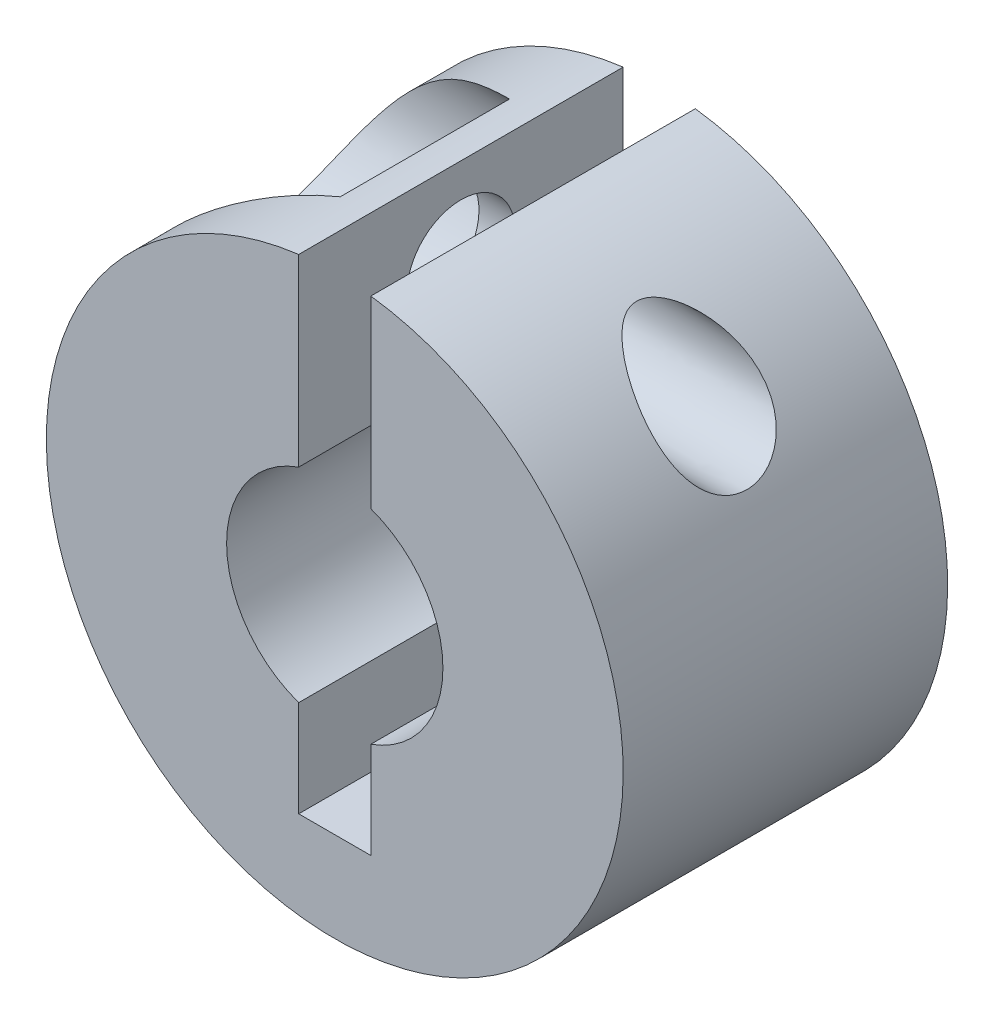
ISO-10303-21;
HEADER;
FILE_DESCRIPTION(('STEP AP214'),'2;1');
FILE_NAME('part.step','',(''),(''),'','','');
FILE_SCHEMA(('AUTOMOTIVE_DESIGN { 1 0 10303 214 1 1 1 1 }'));
ENDSEC;
DATA;
#1=APPLICATION_CONTEXT('core data for automotive mechanical design processes');
#2=APPLICATION_PROTOCOL_DEFINITION('international standard','automotive_design',2000,#1);
#3=PRODUCT_CONTEXT('',#1,'mechanical');
#4=PRODUCT('Part','Part','',(#3));
#5=PRODUCT_RELATED_PRODUCT_CATEGORY('part','',(#4));
#6=PRODUCT_DEFINITION_FORMATION('','',#4);
#7=PRODUCT_DEFINITION_CONTEXT('part definition',#1,'design');
#8=PRODUCT_DEFINITION('design','',#6,#7);
#9=PRODUCT_DEFINITION_SHAPE('','',#8);
#10=(LENGTH_UNIT() NAMED_UNIT(*) SI_UNIT(.MILLI.,.METRE.));
#11=(NAMED_UNIT(*) PLANE_ANGLE_UNIT() SI_UNIT($,.RADIAN.));
#12=(NAMED_UNIT(*) SI_UNIT($,.STERADIAN.) SOLID_ANGLE_UNIT());
#13=UNCERTAINTY_MEASURE_WITH_UNIT(LENGTH_MEASURE(1.E-05),#10,'distance_accuracy_value','');
#14=(GEOMETRIC_REPRESENTATION_CONTEXT(3) GLOBAL_UNCERTAINTY_ASSIGNED_CONTEXT((#13)) GLOBAL_UNIT_ASSIGNED_CONTEXT((#10,
#11,#12)) REPRESENTATION_CONTEXT('',''));
#15=CARTESIAN_POINT('',(0.,0.,0.));
#16=DIRECTION('',(0.,0.,1.));
#17=DIRECTION('',(1.,0.,0.));
#18=AXIS2_PLACEMENT_3D('',#15,#16,#17);
#19=CARTESIAN_POINT('',(0.,0.,4.5));
#20=DIRECTION('',(0.,0.,1.));
#21=DIRECTION('',(1.,0.,0.));
#22=AXIS2_PLACEMENT_3D('',#19,#20,#21);
#23=PLANE('',#22);
#24=DIRECTION('',(0.,-1.,0.));
#25=VECTOR('',#24,1.);
#26=CARTESIAN_POINT('',(1.,-2.75,4.5));
#27=LINE('',#26,#25);
#28=CARTESIAN_POINT('',(1.,7.93725393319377,4.5));
#29=VERTEX_POINT('',#28);
#30=CARTESIAN_POINT('',(1.,2.82842712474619,4.5));
#31=VERTEX_POINT('',#30);
#32=EDGE_CURVE('E10',#29,#31,#27,.T.);
#33=ORIENTED_EDGE('',*,*,#32,.T.);
#34=CARTESIAN_POINT('',(0.,0.,4.5));
#35=DIRECTION('',(0.,0.,1.));
#36=DIRECTION('',(1.,0.,0.));
#37=AXIS2_PLACEMENT_3D('',#34,#35,#36);
#38=CIRCLE('',#37,3.);
#39=CARTESIAN_POINT('',(1.,-2.82842712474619,4.5));
#40=VERTEX_POINT('',#39);
#41=EDGE_CURVE('E187',#40,#31,#38,.T.);
#42=ORIENTED_EDGE('',*,*,#41,.F.);
#43=DIRECTION('',(0.,-1.,0.));
#44=VECTOR('',#43,1.);
#45=CARTESIAN_POINT('',(1.,-2.75,4.5));
#46=LINE('',#45,#44);
#47=CARTESIAN_POINT('',(1.,-5.5,4.5));
#48=VERTEX_POINT('',#47);
#49=EDGE_CURVE('E30',#40,#48,#46,.T.);
#50=ORIENTED_EDGE('',*,*,#49,.T.);
#51=DIRECTION('',(-1.,0.,0.));
#52=VECTOR('',#51,1.);
#53=CARTESIAN_POINT('',(-0.5,-5.5,4.5));
#54=LINE('',#53,#52);
#55=CARTESIAN_POINT('',(-1.,-5.5,4.5));
#56=VERTEX_POINT('',#55);
#57=EDGE_CURVE('E135',#48,#56,#54,.T.);
#58=ORIENTED_EDGE('',*,*,#57,.T.);
#59=DIRECTION('',(0.,1.,0.));
#60=VECTOR('',#59,1.);
#61=CARTESIAN_POINT('',(-1.,4.,4.5));
#62=LINE('',#61,#60);
#63=CARTESIAN_POINT('',(-1.,-2.82842712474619,4.5));
#64=VERTEX_POINT('',#63);
#65=EDGE_CURVE('E113',#56,#64,#62,.T.);
#66=ORIENTED_EDGE('',*,*,#65,.T.);
#67=CARTESIAN_POINT('',(0.,0.,4.5));
#68=DIRECTION('',(0.,0.,1.));
#69=DIRECTION('',(1.,0.,0.));
#70=AXIS2_PLACEMENT_3D('',#67,#68,#69);
#71=CIRCLE('',#70,3.);
#72=CARTESIAN_POINT('',(-1.,2.82842712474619,4.5));
#73=VERTEX_POINT('',#72);
#74=EDGE_CURVE('E107',#73,#64,#71,.T.);
#75=ORIENTED_EDGE('',*,*,#74,.F.);
#76=DIRECTION('',(0.,1.,0.));
#77=VECTOR('',#76,1.);
#78=CARTESIAN_POINT('',(-1.,4.,4.5));
#79=LINE('',#78,#77);
#80=CARTESIAN_POINT('',(-1.,7.93725393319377,4.5));
#81=VERTEX_POINT('',#80);
#82=EDGE_CURVE('E110',#73,#81,#79,.T.);
#83=ORIENTED_EDGE('',*,*,#82,.T.);
#84=CARTESIAN_POINT('',(0.,0.,4.5));
#85=DIRECTION('',(0.,0.,1.));
#86=DIRECTION('',(1.,0.,0.));
#87=AXIS2_PLACEMENT_3D('',#84,#85,#86);
#88=CIRCLE('',#87,8.);
#89=EDGE_CURVE('E123',#81,#29,#88,.T.);
#90=ORIENTED_EDGE('',*,*,#89,.T.);
#91=EDGE_LOOP('',(#33,#42,#50,#58,#66,#75,#83,#90));
#92=FACE_BOUND('',#91,.T.);
#93=ADVANCED_FACE('F15',(#92),#23,.T.);
#94=CARTESIAN_POINT('',(0.,0.,-4.5));
#95=DIRECTION('',(0.,0.,-1.));
#96=DIRECTION('',(-1.,0.,0.));
#97=AXIS2_PLACEMENT_3D('',#94,#95,#96);
#98=PLANE('',#97);
#99=DIRECTION('',(0.,1.,0.));
#100=VECTOR('',#99,1.);
#101=CARTESIAN_POINT('',(1.,-2.75,-4.5));
#102=LINE('',#101,#100);
#103=CARTESIAN_POINT('',(1.,2.82842712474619,-4.5));
#104=VERTEX_POINT('',#103);
#105=CARTESIAN_POINT('',(1.,7.93725393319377,-4.5));
#106=VERTEX_POINT('',#105);
#107=EDGE_CURVE('E139',#104,#106,#102,.T.);
#108=ORIENTED_EDGE('',*,*,#107,.T.);
#109=CARTESIAN_POINT('',(0.,0.,-4.5));
#110=DIRECTION('',(0.,0.,1.));
#111=DIRECTION('',(1.,0.,0.));
#112=AXIS2_PLACEMENT_3D('',#109,#110,#111);
#113=CIRCLE('',#112,8.);
#114=CARTESIAN_POINT('',(-1.,7.93725393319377,-4.5));
#115=VERTEX_POINT('',#114);
#116=EDGE_CURVE('E133',#115,#106,#113,.T.);
#117=ORIENTED_EDGE('',*,*,#116,.F.);
#118=DIRECTION('',(0.,-1.,0.));
#119=VECTOR('',#118,1.);
#120=CARTESIAN_POINT('',(-1.,4.,-4.5));
#121=LINE('',#120,#119);
#122=CARTESIAN_POINT('',(-1.,2.82842712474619,-4.5));
#123=VERTEX_POINT('',#122);
#124=EDGE_CURVE('E141',#115,#123,#121,.T.);
#125=ORIENTED_EDGE('',*,*,#124,.T.);
#126=CARTESIAN_POINT('',(0.,0.,-4.5));
#127=DIRECTION('',(0.,0.,-1.));
#128=DIRECTION('',(1.,0.,0.));
#129=AXIS2_PLACEMENT_3D('',#126,#127,#128);
#130=CIRCLE('',#129,3.);
#131=CARTESIAN_POINT('',(-1.,-2.82842712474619,-4.5));
#132=VERTEX_POINT('',#131);
#133=EDGE_CURVE('E127',#132,#123,#130,.T.);
#134=ORIENTED_EDGE('',*,*,#133,.F.);
#135=DIRECTION('',(0.,-1.,0.));
#136=VECTOR('',#135,1.);
#137=CARTESIAN_POINT('',(-1.,4.,-4.5));
#138=LINE('',#137,#136);
#139=CARTESIAN_POINT('',(-1.,-5.5,-4.5));
#140=VERTEX_POINT('',#139);
#141=EDGE_CURVE('E202',#132,#140,#138,.T.);
#142=ORIENTED_EDGE('',*,*,#141,.T.);
#143=DIRECTION('',(1.,0.,0.));
#144=VECTOR('',#143,1.);
#145=CARTESIAN_POINT('',(-0.5,-5.5,-4.5));
#146=LINE('',#145,#144);
#147=CARTESIAN_POINT('',(1.,-5.5,-4.5));
#148=VERTEX_POINT('',#147);
#149=EDGE_CURVE('E199',#140,#148,#146,.T.);
#150=ORIENTED_EDGE('',*,*,#149,.T.);
#151=DIRECTION('',(0.,1.,0.));
#152=VECTOR('',#151,1.);
#153=CARTESIAN_POINT('',(1.,-2.75,-4.5));
#154=LINE('',#153,#152);
#155=CARTESIAN_POINT('',(1.,-2.82842712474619,-4.5));
#156=VERTEX_POINT('',#155);
#157=EDGE_CURVE('E191',#148,#156,#154,.T.);
#158=ORIENTED_EDGE('',*,*,#157,.T.);
#159=CARTESIAN_POINT('',(0.,0.,-4.5));
#160=DIRECTION('',(0.,0.,-1.));
#161=DIRECTION('',(1.,0.,0.));
#162=AXIS2_PLACEMENT_3D('',#159,#160,#161);
#163=CIRCLE('',#162,3.);
#164=EDGE_CURVE('E88',#104,#156,#163,.T.);
#165=ORIENTED_EDGE('',*,*,#164,.F.);
#166=EDGE_LOOP('',(#108,#117,#125,#134,#142,#150,#158,#165));
#167=FACE_BOUND('',#166,.T.);
#168=ADVANCED_FACE('F209',(#167),#98,.T.);
#169=CARTESIAN_POINT('',(-1.,8.,9.));
#170=DIRECTION('',(1.,0.,0.));
#171=DIRECTION('',(0.,0.,-1.));
#172=AXIS2_PLACEMENT_3D('',#169,#170,#171);
#173=PLANE('',#172);
#174=ORIENTED_EDGE('',*,*,#141,.F.);
#175=DIRECTION('',(0.,0.,-1.));
#176=VECTOR('',#175,1.);
#177=CARTESIAN_POINT('',(-1.,-2.82842712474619,0.));
#178=LINE('',#177,#176);
#179=EDGE_CURVE('E101',#64,#132,#178,.T.);
#180=ORIENTED_EDGE('',*,*,#179,.F.);
#181=ORIENTED_EDGE('',*,*,#65,.F.);
#182=DIRECTION('',(0.,0.,-1.));
#183=VECTOR('',#182,1.);
#184=CARTESIAN_POINT('',(-1.,-5.5,9.));
#185=LINE('',#184,#183);
#186=EDGE_CURVE('E189',#56,#140,#185,.T.);
#187=ORIENTED_EDGE('',*,*,#186,.T.);
#188=EDGE_LOOP('',(#174,#180,#181,#187));
#189=FACE_BOUND('',#188,.T.);
#190=ADVANCED_FACE('F211',(#189),#173,.T.);
#191=CARTESIAN_POINT('',(-1.,-5.5,9.));
#192=DIRECTION('',(0.,1.,0.));
#193=DIRECTION('',(0.,0.,1.));
#194=AXIS2_PLACEMENT_3D('',#191,#192,#193);
#195=PLANE('',#194);
#196=ORIENTED_EDGE('',*,*,#149,.F.);
#197=ORIENTED_EDGE('',*,*,#186,.F.);
#198=ORIENTED_EDGE('',*,*,#57,.F.);
#199=DIRECTION('',(0.,0.,-1.));
#200=VECTOR('',#199,1.);
#201=CARTESIAN_POINT('',(1.,-5.5,9.));
#202=LINE('',#201,#200);
#203=EDGE_CURVE('E182',#48,#148,#202,.T.);
#204=ORIENTED_EDGE('',*,*,#203,.T.);
#205=EDGE_LOOP('',(#196,#197,#198,#204));
#206=FACE_BOUND('',#205,.T.);
#207=ADVANCED_FACE('F218',(#206),#195,.T.);
#208=CARTESIAN_POINT('',(-1.,8.,9.));
#209=DIRECTION('',(1.,0.,0.));
#210=DIRECTION('',(0.,0.,-1.));
#211=AXIS2_PLACEMENT_3D('',#208,#209,#210);
#212=PLANE('',#211);
#213=CARTESIAN_POINT('',(-1.,5.50000000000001,0.));
#214=DIRECTION('',(-1.,0.,0.));
#215=DIRECTION('',(0.,1.,0.));
#216=AXIS2_PLACEMENT_3D('',#213,#214,#215);
#217=CIRCLE('',#216,1.49999999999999);
#218=CARTESIAN_POINT('',(-1.,7.,0.));
#219=VERTEX_POINT('',#218);
#220=EDGE_CURVE('E177',#219,#219,#217,.T.);
#221=ORIENTED_EDGE('',*,*,#220,.T.);
#222=EDGE_LOOP('',(#221));
#223=FACE_BOUND('',#222,.T.);
#224=DIRECTION('',(0.,0.,-1.));
#225=VECTOR('',#224,1.);
#226=CARTESIAN_POINT('',(-1.,7.93725393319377,0.));
#227=LINE('',#226,#225);
#228=EDGE_CURVE('E122',#81,#115,#227,.T.);
#229=ORIENTED_EDGE('',*,*,#228,.F.);
#230=ORIENTED_EDGE('',*,*,#82,.F.);
#231=DIRECTION('',(0.,0.,1.));
#232=VECTOR('',#231,1.);
#233=CARTESIAN_POINT('',(-1.,2.82842712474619,0.));
#234=LINE('',#233,#232);
#235=EDGE_CURVE('E116',#123,#73,#234,.T.);
#236=ORIENTED_EDGE('',*,*,#235,.F.);
#237=ORIENTED_EDGE('',*,*,#124,.F.);
#238=EDGE_LOOP('',(#229,#230,#236,#237));
#239=FACE_BOUND('',#238,.T.);
#240=ADVANCED_FACE('F120',(#223,#239),#212,.T.);
#241=CARTESIAN_POINT('',(1.,-5.5,9.));
#242=DIRECTION('',(-1.,0.,0.));
#243=DIRECTION('',(0.,0.,1.));
#244=AXIS2_PLACEMENT_3D('',#241,#242,#243);
#245=PLANE('',#244);
#246=ORIENTED_EDGE('',*,*,#157,.F.);
#247=ORIENTED_EDGE('',*,*,#203,.F.);
#248=ORIENTED_EDGE('',*,*,#49,.F.);
#249=DIRECTION('',(0.,0.,1.));
#250=VECTOR('',#249,1.);
#251=CARTESIAN_POINT('',(1.,-2.82842712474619,0.));
#252=LINE('',#251,#250);
#253=EDGE_CURVE('E137',#156,#40,#252,.T.);
#254=ORIENTED_EDGE('',*,*,#253,.F.);
#255=EDGE_LOOP('',(#246,#247,#248,#254));
#256=FACE_BOUND('',#255,.T.);
#257=ADVANCED_FACE('F227',(#256),#245,.T.);
#258=CARTESIAN_POINT('',(1.,-5.5,9.));
#259=DIRECTION('',(-1.,0.,0.));
#260=DIRECTION('',(0.,0.,1.));
#261=AXIS2_PLACEMENT_3D('',#258,#259,#260);
#262=PLANE('',#261);
#263=CARTESIAN_POINT('',(1.,5.50000000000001,0.));
#264=DIRECTION('',(1.,0.,0.));
#265=DIRECTION('',(0.,1.,0.));
#266=AXIS2_PLACEMENT_3D('',#263,#264,#265);
#267=CIRCLE('',#266,1.49999999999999);
#268=CARTESIAN_POINT('',(1.,7.,0.));
#269=VERTEX_POINT('',#268);
#270=EDGE_CURVE('E174',#269,#269,#267,.T.);
#271=ORIENTED_EDGE('',*,*,#270,.T.);
#272=EDGE_LOOP('',(#271));
#273=FACE_BOUND('',#272,.T.);
#274=DIRECTION('',(0.,0.,1.));
#275=VECTOR('',#274,1.);
#276=CARTESIAN_POINT('',(1.,7.93725393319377,0.));
#277=LINE('',#276,#275);
#278=EDGE_CURVE('E195',#106,#29,#277,.T.);
#279=ORIENTED_EDGE('',*,*,#278,.F.);
#280=ORIENTED_EDGE('',*,*,#107,.F.);
#281=DIRECTION('',(0.,0.,-1.));
#282=VECTOR('',#281,1.);
#283=CARTESIAN_POINT('',(1.,2.82842712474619,0.));
#284=LINE('',#283,#282);
#285=EDGE_CURVE('E39',#31,#104,#284,.T.);
#286=ORIENTED_EDGE('',*,*,#285,.F.);
#287=ORIENTED_EDGE('',*,*,#32,.F.);
#288=EDGE_LOOP('',(#279,#280,#286,#287));
#289=FACE_BOUND('',#288,.T.);
#290=ADVANCED_FACE('F205',(#273,#289),#262,.T.);
#291=CARTESIAN_POINT('',(-2.,7.875,0.));
#292=DIRECTION('',(-1.,0.,0.));
#293=DIRECTION('',(0.,-1.,0.));
#294=AXIS2_PLACEMENT_3D('',#291,#292,#293);
#295=PLANE('',#294);
#296=CARTESIAN_POINT('',(-2.,5.50000000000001,0.));
#297=DIRECTION('',(-1.,0.,0.));
#298=DIRECTION('',(0.,1.,0.));
#299=AXIS2_PLACEMENT_3D('',#296,#297,#298);
#300=CIRCLE('',#299,1.49999999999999);
#301=CARTESIAN_POINT('',(-2.,7.,0.));
#302=VERTEX_POINT('',#301);
#303=EDGE_CURVE('E192',#302,#302,#300,.T.);
#304=ORIENTED_EDGE('',*,*,#303,.F.);
#305=EDGE_LOOP('',(#304));
#306=FACE_BOUND('',#305,.T.);
#307=DIRECTION('',(0.,0.,1.));
#308=VECTOR('',#307,1.);
#309=CARTESIAN_POINT('',(-2.,7.74596669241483,0.));
#310=LINE('',#309,#308);
#311=CARTESIAN_POINT('',(-2.,7.74596669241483,-2.34907079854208));
#312=VERTEX_POINT('',#311);
#313=CARTESIAN_POINT('',(-2.,7.74596669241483,2.34907079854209));
#314=VERTEX_POINT('',#313);
#315=EDGE_CURVE('E160',#312,#314,#310,.T.);
#316=ORIENTED_EDGE('',*,*,#315,.F.);
#317=CARTESIAN_POINT('',(-2.,5.50000000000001,0.));
#318=DIRECTION('',(-1.,0.,0.));
#319=DIRECTION('',(0.,1.,0.));
#320=AXIS2_PLACEMENT_3D('',#317,#318,#319);
#321=CIRCLE('',#320,3.24999999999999);
#322=EDGE_CURVE('E161',#312,#314,#321,.T.);
#323=ORIENTED_EDGE('',*,*,#322,.T.);
#324=EDGE_LOOP('',(#316,#323));
#325=FACE_BOUND('',#324,.T.);
#326=ADVANCED_FACE('F152',(#306,#325),#295,.T.);
#327=CARTESIAN_POINT('',(-5.,5.50000000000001,0.));
#328=DIRECTION('',(1.,0.,0.));
#329=DIRECTION('',(0.,1.,0.));
#330=AXIS2_PLACEMENT_3D('',#327,#328,#329);
#331=CIRCLE('',#330,3.24999999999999);
#332=DIRECTION('',(-1.,0.,0.));
#333=VECTOR('',#332,1.);
#334=SURFACE_OF_LINEAR_EXTRUSION('',#331,#333);
#335=ORIENTED_EDGE('',*,*,#322,.F.);
#336=CARTESIAN_POINT('',(-2.,7.74596669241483,2.34907079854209));
#337=CARTESIAN_POINT('',(-2.11052373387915,7.71742540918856,2.37636543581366));
#338=CARTESIAN_POINT('',(-2.22015109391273,7.68660054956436,2.40483628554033));
#339=CARTESIAN_POINT('',(-2.43759075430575,7.62043838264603,2.46336827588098));
#340=CARTESIAN_POINT('',(-2.54540328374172,7.58510164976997,2.49342921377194));
#341=CARTESIAN_POINT('',(-2.75937745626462,7.509907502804,2.55443172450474));
#342=CARTESIAN_POINT('',(-2.86553641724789,7.47004346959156,2.5853745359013));
#343=CARTESIAN_POINT('',(-3.07602422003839,7.38585963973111,2.64740782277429));
#344=CARTESIAN_POINT('',(-3.1803530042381,7.34153970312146,2.6784983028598));
#345=CARTESIAN_POINT('',(-3.49307493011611,7.20077330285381,2.77175677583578));
#346=CARTESIAN_POINT('',(-3.6986430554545,7.09741866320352,2.83315030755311));
#347=CARTESIAN_POINT('',(-4.10150047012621,6.87246899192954,2.94869777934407));
#348=CARTESIAN_POINT('',(-4.29879718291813,6.75089078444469,3.00285831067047));
#349=CARTESIAN_POINT('',(-4.61006459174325,6.53971398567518,3.08039677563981));
#350=CARTESIAN_POINT('',(-4.72693341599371,6.45576848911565,3.10760790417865));
#351=CARTESIAN_POINT('',(-4.95676268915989,6.28102976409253,3.15605969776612));
#352=CARTESIAN_POINT('',(-5.06972311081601,6.19023648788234,3.17730032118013));
#353=CARTESIAN_POINT('',(-5.2907572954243,6.00240252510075,3.21234852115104));
#354=CARTESIAN_POINT('',(-5.39884896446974,5.90538857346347,3.226185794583));
#355=CARTESIAN_POINT('',(-5.60998142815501,5.70519510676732,3.24507278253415));
#356=CARTESIAN_POINT('',(-5.71302350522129,5.60201717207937,3.25012473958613));
#357=CARTESIAN_POINT('',(-5.89138110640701,5.41337235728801,3.24989840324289));
#358=CARTESIAN_POINT('',(-5.96782887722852,5.32897190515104,3.24663914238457));
#359=CARTESIAN_POINT('',(-6.11677922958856,5.15731661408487,3.23302909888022));
#360=CARTESIAN_POINT('',(-6.18928272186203,5.0700624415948,3.22267996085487));
#361=CARTESIAN_POINT('',(-6.32991195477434,4.893358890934,3.19413425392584));
#362=CARTESIAN_POINT('',(-6.39803888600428,4.80391011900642,3.1759398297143));
#363=CARTESIAN_POINT('',(-6.52949952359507,4.62364262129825,3.1309936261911));
#364=CARTESIAN_POINT('',(-6.59283405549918,4.53282413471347,3.10424332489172));
#365=CARTESIAN_POINT('',(-6.70417129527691,4.36605098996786,3.0468160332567));
#366=CARTESIAN_POINT('',(-6.75296918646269,4.29014396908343,3.01753839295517));
#367=CARTESIAN_POINT('',(-6.84675612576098,4.13882224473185,2.95236824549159));
#368=CARTESIAN_POINT('',(-6.89174580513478,4.06340746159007,2.91647683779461));
#369=CARTESIAN_POINT('',(-6.97775308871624,3.91387280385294,2.83792716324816));
#370=CARTESIAN_POINT('',(-7.01877180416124,3.83975257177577,2.79527079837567));
#371=CARTESIAN_POINT('',(-7.09675528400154,3.69363279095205,2.70314560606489));
#372=CARTESIAN_POINT('',(-7.13371998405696,3.62163327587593,2.65367667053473));
#373=CARTESIAN_POINT('',(-7.2037143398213,3.48033667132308,2.54780021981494));
#374=CARTESIAN_POINT('',(-7.23672665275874,3.41105232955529,2.49136418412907));
#375=CARTESIAN_POINT('',(-7.29867730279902,3.27640098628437,2.37196195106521));
#376=CARTESIAN_POINT('',(-7.3276158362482,3.21103379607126,2.3089960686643));
#377=CARTESIAN_POINT('',(-7.38154093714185,3.08505284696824,2.17689282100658));
#378=CARTESIAN_POINT('',(-7.40652685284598,3.02443987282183,2.10775444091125));
#379=CARTESIAN_POINT('',(-7.45271481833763,2.90876642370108,1.9638056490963));
#380=CARTESIAN_POINT('',(-7.47391711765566,2.85370558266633,1.88899561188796));
#381=CARTESIAN_POINT('',(-7.5113018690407,2.75372064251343,1.7400809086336));
#382=CARTESIAN_POINT('',(-7.52774121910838,2.70834634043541,1.66634227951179));
#383=CARTESIAN_POINT('',(-7.55776314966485,2.6234036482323,1.51500048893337));
#384=CARTESIAN_POINT('',(-7.57134465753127,2.58383743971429,1.43739588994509));
#385=CARTESIAN_POINT('',(-7.59582190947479,2.51096955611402,1.27897956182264));
#386=CARTESIAN_POINT('',(-7.60672019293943,2.47766196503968,1.1981709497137));
#387=CARTESIAN_POINT('',(-7.62602628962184,2.41758415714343,1.03386401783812));
#388=CARTESIAN_POINT('',(-7.63443344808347,2.39081565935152,0.950364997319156));
#389=CARTESIAN_POINT('',(-7.65369968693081,2.32864186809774,0.725377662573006));
#390=CARTESIAN_POINT('',(-7.6625117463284,2.29920631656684,0.582007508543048));
#391=CARTESIAN_POINT('',(-7.67419951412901,2.259882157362,0.292440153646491));
#392=CARTESIAN_POINT('',(-7.67707517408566,2.24999370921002,0.146242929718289));
#393=CARTESIAN_POINT('',(-7.67707757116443,2.25000751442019,-0.174688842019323));
#394=CARTESIAN_POINT('',(-7.6729772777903,2.26413341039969,-0.349442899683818));
#395=CARTESIAN_POINT('',(-7.65621356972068,2.32017765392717,-0.694077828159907));
#396=CARTESIAN_POINT('',(-7.64354571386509,2.36211041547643,-0.863956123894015));
#397=CARTESIAN_POINT('',(-7.60862943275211,2.47226165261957,-1.19396326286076));
#398=CARTESIAN_POINT('',(-7.58637995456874,2.54048301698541,-1.35409103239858));
#399=CARTESIAN_POINT('',(-7.53087885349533,2.7005556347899,-1.65993686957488));
#400=CARTESIAN_POINT('',(-7.49763004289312,2.79240084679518,-1.80565860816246));
#401=CARTESIAN_POINT('',(-7.41884638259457,2.99540804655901,-2.07803352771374));
#402=CARTESIAN_POINT('',(-7.37337305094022,3.10647234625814,-2.20477737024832));
#403=CARTESIAN_POINT('',(-7.26899265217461,3.3434211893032,-2.43704674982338));
#404=CARTESIAN_POINT('',(-7.21008622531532,3.46930502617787,-2.54257329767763));
#405=CARTESIAN_POINT('',(-7.077653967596,3.73211723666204,-2.73197042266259));
#406=CARTESIAN_POINT('',(-7.00395551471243,3.86916344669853,-2.81555550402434));
#407=CARTESIAN_POINT('',(-6.84288951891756,4.14737462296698,-2.95929989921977));
#408=CARTESIAN_POINT('',(-6.75551808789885,4.28854075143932,-3.01945253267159));
#409=CARTESIAN_POINT('',(-6.56027952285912,4.58218301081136,-3.12191110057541));
#410=CARTESIAN_POINT('',(-6.45129914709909,4.73459518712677,-3.16225360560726));
#411=CARTESIAN_POINT('',(-6.22055840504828,5.03392702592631,-3.22002361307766));
#412=CARTESIAN_POINT('',(-6.09879170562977,5.18084391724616,-3.2374397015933));
#413=CARTESIAN_POINT('',(-5.87136622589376,5.43597783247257,-3.25132545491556));
#414=CARTESIAN_POINT('',(-5.76771187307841,5.54583149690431,-3.25143248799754));
#415=CARTESIAN_POINT('',(-5.55456662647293,5.7593005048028,-3.24140159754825));
#416=CARTESIAN_POINT('',(-5.44507296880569,5.8629128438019,-3.2312587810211));
#417=CARTESIAN_POINT('',(-5.22078005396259,6.06351074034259,-3.20238244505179));
#418=CARTESIAN_POINT('',(-5.10596768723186,6.1604782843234,-3.18362655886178));
#419=CARTESIAN_POINT('',(-4.87190452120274,6.34720200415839,-3.13910229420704));
#420=CARTESIAN_POINT('',(-4.75265231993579,6.43695587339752,-3.11333168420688));
#421=CARTESIAN_POINT('',(-4.45236581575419,6.65016265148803,-3.04262562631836));
#422=CARTESIAN_POINT('',(-4.26900200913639,6.76926117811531,-2.99441286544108));
#423=CARTESIAN_POINT('',(-3.89475873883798,6.99129878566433,-2.89025438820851));
#424=CARTESIAN_POINT('',(-3.70387414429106,7.09422658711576,-2.8343033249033));
#425=CARTESIAN_POINT('',(-3.31561102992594,7.28377146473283,-2.71899562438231));
#426=CARTESIAN_POINT('',(-3.11824359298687,7.37041483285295,-2.65964468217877));
#427=CARTESIAN_POINT('',(-2.71705169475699,7.52754908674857,-2.54188175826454));
#428=CARTESIAN_POINT('',(-2.51323268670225,7.598053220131,-2.48346904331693));
#429=CARTESIAN_POINT('',(-2.25554871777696,7.67563007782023,-2.41444690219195));
#430=CARTESIAN_POINT('',(-2.20468289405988,7.69039553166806,-2.40105102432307));
#431=CARTESIAN_POINT('',(-2.10261001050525,7.71892722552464,-2.37470784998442));
#432=CARTESIAN_POINT('',(-2.05140330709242,7.73269437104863,-2.36176015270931));
#433=CARTESIAN_POINT('',(-1.9999999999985,7.745966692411,-2.34907079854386));
#434=B_SPLINE_CURVE_WITH_KNOTS('',3,(#336,#337,#338,#339,#340,#341,#342,#343,#344,#345,#346,
#347,#348,#349,#350,#351,#352,#353,#354,#355,#356,#357,#358,#359,#360,#361,#362,#363,#364,#365,
#366,#367,#368,#369,#370,#371,#372,#373,#374,#375,#376,#377,#378,#379,#380,#381,#382,#383,#384,
#385,#386,#387,#388,#389,#390,#391,#392,#393,#394,#395,#396,#397,#398,#399,#400,#401,#402,#403,
#404,#405,#406,#407,#408,#409,#410,#411,#412,#413,#414,#415,#416,#417,#418,#419,#420,#421,#422,
#423,#424,#425,#426,#427,#428,#429,#430,#431,#432,#433),.UNSPECIFIED.,.F.,.F.,(4,2,2,2,2,2,2,2,
2,2,2,2,2,2,2,2,2,2,2,2,2,2,2,2,2,2,2,2,2,2,2,2,2,2,2,2,2,2,2,2,2,2,2,2,2,2,2,2,4),(0.,
0.352048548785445,0.704052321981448,1.05657753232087,1.4091138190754,2.12261592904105,
2.83546333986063,3.27450964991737,3.71355902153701,4.15083378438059,4.58799691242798,
4.929474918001,5.27087373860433,5.61217928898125,5.95342591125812,6.23774927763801,
6.52202542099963,6.8062217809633,7.09042265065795,7.37582810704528,7.66121980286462,
7.94665850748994,8.23207838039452,8.49614249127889,8.76030553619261,9.02421760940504,
9.28819898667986,9.72650364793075,10.1648118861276,10.6883760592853,11.212211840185,
11.7361052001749,12.2598647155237,12.781036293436,13.3021830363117,13.8298077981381,
14.3575828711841,14.9304415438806,15.5035853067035,15.9560883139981,16.4088074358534,
16.8627089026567,17.316754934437,17.9874440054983,18.6585988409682,19.328660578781,
19.998170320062,20.1620623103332,20.32580373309),.UNSPECIFIED.);
#435=EDGE_CURVE('E78',#314,#312,#434,.T.);
#436=ORIENTED_EDGE('',*,*,#435,.F.);
#437=EDGE_LOOP('',(#335,#436));
#438=FACE_BOUND('',#437,.T.);
#439=ADVANCED_FACE('F147',(#438),#334,.T.);
#440=CARTESIAN_POINT('',(6.,5.50000000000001,0.));
#441=DIRECTION('',(1.,0.,0.));
#442=DIRECTION('',(0.,1.,0.));
#443=AXIS2_PLACEMENT_3D('',#440,#441,#442);
#444=CIRCLE('',#443,1.49999999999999);
#445=DIRECTION('',(-1.,0.,0.));
#446=VECTOR('',#445,1.);
#447=SURFACE_OF_LINEAR_EXTRUSION('',#444,#446);
#448=CARTESIAN_POINT('',(6.9282032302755,4.00000000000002,0.));
#449=CARTESIAN_POINT('',(6.92820103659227,4.00000597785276,0.075058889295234));
#450=CARTESIAN_POINT('',(6.92493568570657,4.0056775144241,0.150242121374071));
#451=CARTESIAN_POINT('',(6.91519617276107,4.02244874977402,0.261263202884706));
#452=CARTESIAN_POINT('',(6.91113455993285,4.02943053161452,0.298023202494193));
#453=CARTESIAN_POINT('',(6.90141118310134,4.04606202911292,0.370748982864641));
#454=CARTESIAN_POINT('',(6.89574843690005,4.05571338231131,0.406714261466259));
#455=CARTESIAN_POINT('',(6.8764413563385,4.08842279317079,0.512733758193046));
#456=CARTESIAN_POINT('',(6.86044999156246,4.11528592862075,0.581232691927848));
#457=CARTESIAN_POINT('',(6.82250063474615,4.17789573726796,0.712264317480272));
#458=CARTESIAN_POINT('',(6.80053922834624,4.21364749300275,0.774793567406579));
#459=CARTESIAN_POINT('',(6.76302636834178,4.27341257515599,0.864196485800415));
#460=CARTESIAN_POINT('',(6.74948181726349,4.29478655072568,0.893738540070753));
#461=CARTESIAN_POINT('',(6.72099607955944,4.33922904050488,0.95074452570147));
#462=CARTESIAN_POINT('',(6.70605646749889,4.36229563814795,0.978210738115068));
#463=CARTESIAN_POINT('',(6.65920942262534,4.43375279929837,1.05743579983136));
#464=CARTESIAN_POINT('',(6.62527744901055,4.4843948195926,1.1060123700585));
#465=CARTESIAN_POINT('',(6.54849535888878,4.59590055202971,1.19937244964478));
#466=CARTESIAN_POINT('',(6.50506760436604,4.65726894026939,1.24306628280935));
#467=CARTESIAN_POINT('',(6.4131745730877,4.78301808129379,1.31960721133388));
#468=CARTESIAN_POINT('',(6.36470290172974,4.84740259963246,1.35244031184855));
#469=CARTESIAN_POINT('',(6.27718372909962,4.95989976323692,1.4003450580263));
#470=CARTESIAN_POINT('',(6.23908567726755,5.0077558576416,1.41781850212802));
#471=CARTESIAN_POINT('',(6.16102751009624,5.10348506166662,1.44750997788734));
#472=CARTESIAN_POINT('',(6.12106902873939,5.15135812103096,1.45973252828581));
#473=CARTESIAN_POINT('',(5.99860740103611,5.29456572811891,1.48906079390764));
#474=CARTESIAN_POINT('',(5.91361153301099,5.38936797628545,1.49877825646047));
#475=CARTESIAN_POINT('',(5.76973564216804,5.54229744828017,1.50061696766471));
#476=CARTESIAN_POINT('',(5.71210644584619,5.60166598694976,1.49769981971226));
#477=CARTESIAN_POINT('',(5.59539988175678,5.7182412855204,1.48519463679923));
#478=CARTESIAN_POINT('',(5.53632275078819,5.77544839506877,1.47560768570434));
#479=CARTESIAN_POINT('',(5.41700960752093,5.88750621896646,1.45022402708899));
#480=CARTESIAN_POINT('',(5.35677103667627,5.94235059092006,1.4344116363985));
#481=CARTESIAN_POINT('',(5.23571005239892,6.04928584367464,1.39695855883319));
#482=CARTESIAN_POINT('',(5.1748878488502,6.10137767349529,1.37531989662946));
#483=CARTESIAN_POINT('',(5.05191822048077,6.20359854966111,1.32598316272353));
#484=CARTESIAN_POINT('',(4.98976742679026,6.25367208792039,1.2981785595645));
#485=CARTESIAN_POINT('',(4.86581595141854,6.35059212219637,1.23684340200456));
#486=CARTESIAN_POINT('',(4.80401514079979,6.39743988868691,1.20331512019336));
#487=CARTESIAN_POINT('',(4.68158741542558,6.48756473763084,1.13051383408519));
#488=CARTESIAN_POINT('',(4.62095719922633,6.53085352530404,1.09126094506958));
#489=CARTESIAN_POINT('',(4.50156767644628,6.6137096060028,1.00655910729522));
#490=CARTESIAN_POINT('',(4.44280671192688,6.65328026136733,0.96111584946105));
#491=CARTESIAN_POINT('',(4.33844361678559,6.72168829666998,0.871816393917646));
#492=CARTESIAN_POINT('',(4.29233562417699,6.75119324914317,0.829069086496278));
#493=CARTESIAN_POINT('',(4.20340633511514,6.80691755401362,0.738116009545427));
#494=CARTESIAN_POINT('',(4.16058957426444,6.83313240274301,0.689902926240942));
#495=CARTESIAN_POINT('',(4.0797198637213,6.88172452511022,0.586636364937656));
#496=CARTESIAN_POINT('',(4.04173322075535,6.90404967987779,0.531504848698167));
#497=CARTESIAN_POINT('',(3.97451093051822,6.94296551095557,0.41427775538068));
#498=CARTESIAN_POINT('',(3.9452440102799,6.959576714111,0.352208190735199));
#499=CARTESIAN_POINT('',(3.90684718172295,6.9811806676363,0.241378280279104));
#500=CARTESIAN_POINT('',(3.89430998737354,6.98816407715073,0.194213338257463));
#501=CARTESIAN_POINT('',(3.8773884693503,6.99756804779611,0.0980258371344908));
#502=CARTESIAN_POINT('',(3.87298686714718,6.99999827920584,0.0490074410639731));
#503=CARTESIAN_POINT('',(3.87298012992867,7.00000157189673,-0.0447669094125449));
#504=CARTESIAN_POINT('',(3.87664680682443,6.99797672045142,-0.0895246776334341));
#505=CARTESIAN_POINT('',(3.89082024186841,6.99010590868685,-0.177612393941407));
#506=CARTESIAN_POINT('',(3.90133602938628,6.9842549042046,-0.220940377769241));
#507=CARTESIAN_POINT('',(3.9317501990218,6.96718858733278,-0.316759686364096));
#508=CARTESIAN_POINT('',(3.95343521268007,6.95493957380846,-0.368487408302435));
#509=CARTESIAN_POINT('',(4.00348672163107,6.92624889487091,-0.467427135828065));
#510=CARTESIAN_POINT('',(4.03187722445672,6.90979214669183,-0.514622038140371));
#511=CARTESIAN_POINT('',(4.08806927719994,6.87666869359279,-0.596999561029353));
#512=CARTESIAN_POINT('',(4.11517519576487,6.86049742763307,-0.63287108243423));
#513=CARTESIAN_POINT('',(4.17165171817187,6.82630277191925,-0.701709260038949));
#514=CARTESIAN_POINT('',(4.20101865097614,6.80828236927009,-0.734680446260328));
#515=CARTESIAN_POINT('',(4.26153083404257,6.77057090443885,-0.798132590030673));
#516=CARTESIAN_POINT('',(4.29268123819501,6.75087491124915,-0.828605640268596));
#517=CARTESIAN_POINT('',(4.35624478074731,6.7100343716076,-0.887181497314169));
#518=CARTESIAN_POINT('',(4.38865836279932,6.68888931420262,-0.915283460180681));
#519=CARTESIAN_POINT('',(4.47793941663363,6.62967787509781,-0.988625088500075));
#520=CARTESIAN_POINT('',(4.53570979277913,6.59032931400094,-1.03174021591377));
#521=CARTESIAN_POINT('',(4.65282333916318,6.50817666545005,-1.11215172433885));
#522=CARTESIAN_POINT('',(4.7121672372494,6.46537095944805,-1.1494453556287));
#523=CARTESIAN_POINT('',(4.83172191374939,6.37652064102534,-1.21855703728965));
#524=CARTESIAN_POINT('',(4.8919335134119,6.33047277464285,-1.25036947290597));
#525=CARTESIAN_POINT('',(5.01259941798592,6.23536294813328,-1.30856751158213));
#526=CARTESIAN_POINT('',(5.07305373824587,6.18630079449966,-1.33495276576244));
#527=CARTESIAN_POINT('',(5.19606986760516,6.08338173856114,-1.38311839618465));
#528=CARTESIAN_POINT('',(5.25862314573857,6.02941293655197,-1.40468221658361));
#529=CARTESIAN_POINT('',(5.38304021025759,5.91859949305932,-1.44159121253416));
#530=CARTESIAN_POINT('',(5.44490387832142,5.86175436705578,-1.45693533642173));
#531=CARTESIAN_POINT('',(5.5673659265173,5.74556719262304,-1.48094834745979));
#532=CARTESIAN_POINT('',(5.62796650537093,5.68623014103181,-1.4896299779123));
#533=CARTESIAN_POINT('',(5.7475375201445,5.56534344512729,-1.49980320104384));
#534=CARTESIAN_POINT('',(5.80650803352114,5.5037939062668,-1.50129513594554));
#535=CARTESIAN_POINT('',(5.94715838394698,5.3522011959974,-1.49536634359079));
#536=CARTESIAN_POINT('',(6.02774621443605,5.26124560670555,-1.48385434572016));
#537=CARTESIAN_POINT('',(6.18270854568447,5.07823187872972,-1.44252739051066));
#538=CARTESIAN_POINT('',(6.25709165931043,4.98617547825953,-1.41273830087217));
#539=CARTESIAN_POINT('',(6.38411299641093,4.8220055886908,-1.34042910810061));
#540=CARTESIAN_POINT('',(6.43818511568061,4.74945451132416,-1.30144818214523));
#541=CARTESIAN_POINT('',(6.5396959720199,4.60867577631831,-1.20938113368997));
#542=CARTESIAN_POINT('',(6.58713635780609,4.54044704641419,-1.156298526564));
#543=CARTESIAN_POINT('',(6.6744404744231,4.41112156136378,-1.03548826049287));
#544=CARTESIAN_POINT('',(6.71423602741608,4.35009070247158,-0.96763938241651));
#545=CARTESIAN_POINT('',(6.78445762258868,4.23974455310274,-0.818727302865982));
#546=CARTESIAN_POINT('',(6.81488873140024,4.19042293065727,-0.737671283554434));
#547=CARTESIAN_POINT('',(6.86157183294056,4.11346021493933,-0.578061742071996));
#548=CARTESIAN_POINT('',(6.87926578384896,4.08367706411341,-0.500955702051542));
#549=CARTESIAN_POINT('',(6.90670467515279,4.03709989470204,-0.341703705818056));
#550=CARTESIAN_POINT('',(6.91647216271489,4.02026903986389,-0.259572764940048));
#551=CARTESIAN_POINT('',(6.92418645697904,4.00695029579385,-0.147231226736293));
#552=CARTESIAN_POINT('',(6.92569156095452,4.00434767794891,-0.117869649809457));
#553=CARTESIAN_POINT('',(6.9277003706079,4.00087136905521,-0.0590117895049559));
#554=CARTESIAN_POINT('',(6.92820409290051,3.99999764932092,-0.0295155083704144));
#555=CARTESIAN_POINT('',(6.9282032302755,4.00000000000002,0.));
#556=B_SPLINE_CURVE_WITH_KNOTS('',3,(#448,#449,#450,#451,#452,#453,#454,#455,#456,#457,#458,
#459,#460,#461,#462,#463,#464,#465,#466,#467,#468,#469,#470,#471,#472,#473,#474,#475,#476,#477,
#478,#479,#480,#481,#482,#483,#484,#485,#486,#487,#488,#489,#490,#491,#492,#493,#494,#495,#496,
#497,#498,#499,#500,#501,#502,#503,#504,#505,#506,#507,#508,#509,#510,#511,#512,#513,#514,#515,
#516,#517,#518,#519,#520,#521,#522,#523,#524,#525,#526,#527,#528,#529,#530,#531,#532,#533,#534,
#535,#536,#537,#538,#539,#540,#541,#542,#543,#544,#545,#546,#547,#548,#549,#550,#551,#552,#553,
#554,#555),.UNSPECIFIED.,.T.,.F.,(4,2,2,2,2,2,2,2,2,2,2,2,2,2,2,2,2,2,2,2,2,2,2,2,2,2,2,2,2,2,2,
2,2,2,2,2,2,2,2,2,2,2,2,2,2,2,2,2,2,2,2,2,2,4),(0.,0.225037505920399,0.337841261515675,
0.450714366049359,0.675495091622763,0.900404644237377,1.01699411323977,1.13345354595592,
1.36640548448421,1.6263184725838,1.88656508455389,2.07716477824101,2.26760011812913,
2.64894577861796,2.89705640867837,3.14512672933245,3.39382603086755,3.64243901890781,
3.89573837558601,4.14893739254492,4.40126724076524,4.65336666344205,4.86143812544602,
5.06979137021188,5.28075149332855,5.49094564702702,5.63806479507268,5.78487112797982,
5.91897455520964,6.05325513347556,6.22452543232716,6.39641847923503,6.53956282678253,
6.68247947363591,6.82583230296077,6.96923594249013,7.21524512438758,7.46137015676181,
7.70774583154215,7.95413733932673,8.21002080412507,8.46594751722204,8.72138349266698,
8.97680730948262,9.34163655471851,9.70595064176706,10.0003665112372,10.2947090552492,
10.5915657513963,10.8882615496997,11.1404652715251,11.3919490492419,11.4804423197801,
11.5689341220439),.UNSPECIFIED.);
#557=CARTESIAN_POINT('',(6.9282032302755,4.00000000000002,0.));
#558=VERTEX_POINT('',#557);
#559=EDGE_CURVE('E20',#558,#558,#556,.T.);
#560=ORIENTED_EDGE('',*,*,#559,.F.);
#561=EDGE_LOOP('',(#560));
#562=FACE_BOUND('',#561,.T.);
#563=ORIENTED_EDGE('',*,*,#270,.F.);
#564=EDGE_LOOP('',(#563));
#565=FACE_BOUND('',#564,.T.);
#566=ADVANCED_FACE('F151',(#562,#565),#447,.T.);
#567=CARTESIAN_POINT('',(6.,5.50000000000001,0.));
#568=DIRECTION('',(1.,0.,0.));
#569=DIRECTION('',(0.,1.,0.));
#570=AXIS2_PLACEMENT_3D('',#567,#568,#569);
#571=CIRCLE('',#570,1.49999999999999);
#572=DIRECTION('',(-1.,0.,0.));
#573=VECTOR('',#572,1.);
#574=SURFACE_OF_LINEAR_EXTRUSION('',#571,#573);
#575=ORIENTED_EDGE('',*,*,#220,.F.);
#576=EDGE_LOOP('',(#575));
#577=FACE_BOUND('',#576,.T.);
#578=ORIENTED_EDGE('',*,*,#303,.T.);
#579=EDGE_LOOP('',(#578));
#580=FACE_BOUND('',#579,.T.);
#581=ADVANCED_FACE('F166',(#577,#580),#574,.T.);
#582=CARTESIAN_POINT('',(0.,0.,4.5));
#583=DIRECTION('',(0.,0.,-1.));
#584=DIRECTION('',(-1.,0.,0.));
#585=AXIS2_PLACEMENT_3D('',#582,#583,#584);
#586=CYLINDRICAL_SURFACE('',#585,8.);
#587=ORIENTED_EDGE('',*,*,#315,.T.);
#588=ORIENTED_EDGE('',*,*,#435,.T.);
#589=EDGE_LOOP('',(#587,#588));
#590=FACE_BOUND('',#589,.T.);
#591=ORIENTED_EDGE('',*,*,#89,.F.);
#592=ORIENTED_EDGE('',*,*,#228,.T.);
#593=ORIENTED_EDGE('',*,*,#116,.T.);
#594=ORIENTED_EDGE('',*,*,#278,.T.);
#595=EDGE_LOOP('',(#591,#592,#593,#594));
#596=FACE_BOUND('',#595,.T.);
#597=ORIENTED_EDGE('',*,*,#559,.T.);
#598=EDGE_LOOP('',(#597));
#599=FACE_BOUND('',#598,.T.);
#600=ADVANCED_FACE('F163',(#590,#596,#599),#586,.T.);
#601=CARTESIAN_POINT('',(0.,0.,4.5));
#602=DIRECTION('',(0.,0.,1.));
#603=DIRECTION('',(1.,0.,0.));
#604=AXIS2_PLACEMENT_3D('',#601,#602,#603);
#605=CIRCLE('',#604,3.);
#606=DIRECTION('',(0.,0.,-1.));
#607=VECTOR('',#606,1.);
#608=SURFACE_OF_LINEAR_EXTRUSION('',#605,#607);
#609=ORIENTED_EDGE('',*,*,#133,.T.);
#610=ORIENTED_EDGE('',*,*,#235,.T.);
#611=ORIENTED_EDGE('',*,*,#74,.T.);
#612=ORIENTED_EDGE('',*,*,#179,.T.);
#613=EDGE_LOOP('',(#609,#610,#611,#612));
#614=FACE_BOUND('',#613,.T.);
#615=ADVANCED_FACE('F125',(#614),#608,.T.);
#616=CARTESIAN_POINT('',(0.,0.,4.5));
#617=DIRECTION('',(0.,0.,1.));
#618=DIRECTION('',(1.,0.,0.));
#619=AXIS2_PLACEMENT_3D('',#616,#617,#618);
#620=CIRCLE('',#619,3.);
#621=DIRECTION('',(0.,0.,-1.));
#622=VECTOR('',#621,1.);
#623=SURFACE_OF_LINEAR_EXTRUSION('',#620,#622);
#624=ORIENTED_EDGE('',*,*,#41,.T.);
#625=ORIENTED_EDGE('',*,*,#285,.T.);
#626=ORIENTED_EDGE('',*,*,#164,.T.);
#627=ORIENTED_EDGE('',*,*,#253,.T.);
#628=EDGE_LOOP('',(#624,#625,#626,#627));
#629=FACE_BOUND('',#628,.T.);
#630=ADVANCED_FACE('F17',(#629),#623,.T.);
#631=CLOSED_SHELL('',(#93,#168,#190,#207,#240,#257,#290,#326,#439,#566,#581,#600,#615,#630));
#632=MANIFOLD_SOLID_BREP('B1',#631);
#633=ADVANCED_BREP_SHAPE_REPRESENTATION('',(#18,#632),#14);
#634=SHAPE_DEFINITION_REPRESENTATION(#9,#633);
ENDSEC;
END-ISO-10303-21;
